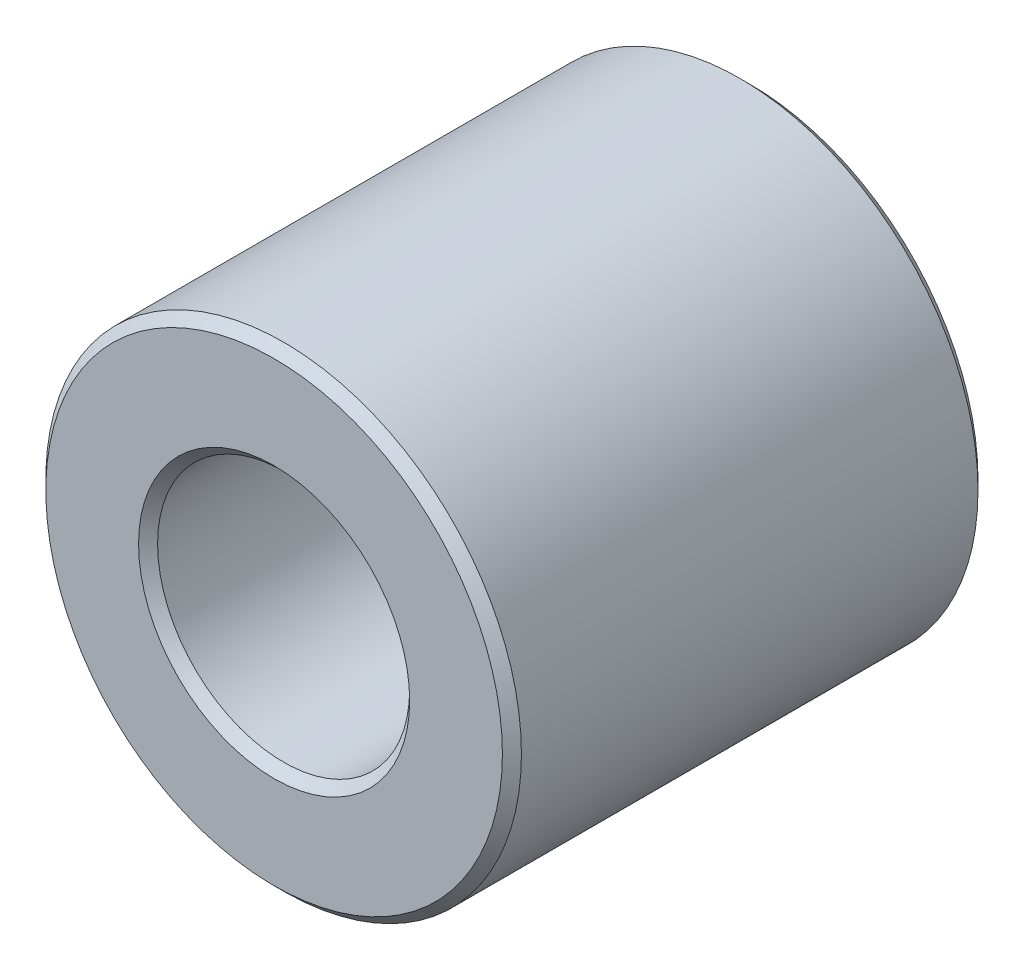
ISO-10303-21;
HEADER;
FILE_DESCRIPTION(('STEP AP214'),'2;1');
FILE_NAME('part.step','',(''),(''),'','','');
FILE_SCHEMA(('AUTOMOTIVE_DESIGN { 1 0 10303 214 1 1 1 1 }'));
ENDSEC;
DATA;
#1=APPLICATION_CONTEXT('core data for automotive mechanical design processes');
#2=APPLICATION_PROTOCOL_DEFINITION('international standard','automotive_design',2000,#1);
#3=PRODUCT_CONTEXT('',#1,'mechanical');
#4=PRODUCT('Part','Part','',(#3));
#5=PRODUCT_RELATED_PRODUCT_CATEGORY('part','',(#4));
#6=PRODUCT_DEFINITION_FORMATION('','',#4);
#7=PRODUCT_DEFINITION_CONTEXT('part definition',#1,'design');
#8=PRODUCT_DEFINITION('design','',#6,#7);
#9=PRODUCT_DEFINITION_SHAPE('','',#8);
#10=(LENGTH_UNIT() NAMED_UNIT(*) SI_UNIT(.MILLI.,.METRE.));
#11=(NAMED_UNIT(*) PLANE_ANGLE_UNIT() SI_UNIT($,.RADIAN.));
#12=(NAMED_UNIT(*) SI_UNIT($,.STERADIAN.) SOLID_ANGLE_UNIT());
#13=UNCERTAINTY_MEASURE_WITH_UNIT(LENGTH_MEASURE(1.E-05),#10,'distance_accuracy_value','');
#14=(GEOMETRIC_REPRESENTATION_CONTEXT(3) GLOBAL_UNCERTAINTY_ASSIGNED_CONTEXT((#13)) GLOBAL_UNIT_ASSIGNED_CONTEXT((#10,
#11,#12)) REPRESENTATION_CONTEXT('',''));
#15=CARTESIAN_POINT('',(0.,0.,0.));
#16=DIRECTION('',(0.,0.,1.));
#17=DIRECTION('',(1.,0.,0.));
#18=AXIS2_PLACEMENT_3D('',#15,#16,#17);
#19=CARTESIAN_POINT('',(0.,0.,5.));
#20=DIRECTION('',(0.,0.,1.));
#21=DIRECTION('',(1.,0.,0.));
#22=AXIS2_PLACEMENT_3D('',#19,#20,#21);
#23=PLANE('',#22);
#24=CARTESIAN_POINT('',(0.,0.,5.));
#25=DIRECTION('',(0.,0.,1.));
#26=DIRECTION('',(1.,0.,0.));
#27=AXIS2_PLACEMENT_3D('',#24,#25,#26);
#28=CIRCLE('',#27,2.85000000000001);
#29=CARTESIAN_POINT('',(2.85000000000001,0.,5.));
#30=VERTEX_POINT('',#29);
#31=EDGE_CURVE('E10',#30,#30,#28,.F.);
#32=ORIENTED_EDGE('',*,*,#31,.T.);
#33=EDGE_LOOP('',(#32));
#34=FACE_BOUND('',#33,.T.);
#35=CARTESIAN_POINT('',(0.,0.,5.));
#36=DIRECTION('',(0.,0.,1.));
#37=DIRECTION('',(1.,0.,0.));
#38=AXIS2_PLACEMENT_3D('',#35,#36,#37);
#39=CIRCLE('',#38,4.8);
#40=CARTESIAN_POINT('',(4.8,0.,5.));
#41=VERTEX_POINT('',#40);
#42=EDGE_CURVE('E45',#41,#41,#39,.T.);
#43=ORIENTED_EDGE('',*,*,#42,.T.);
#44=EDGE_LOOP('',(#43));
#45=FACE_BOUND('',#44,.T.);
#46=ADVANCED_FACE('F37',(#34,#45),#23,.T.);
#47=CARTESIAN_POINT('',(0.,0.,-5.));
#48=DIRECTION('',(0.,0.,1.));
#49=DIRECTION('',(1.,0.,0.));
#50=AXIS2_PLACEMENT_3D('',#47,#48,#49);
#51=PLANE('',#50);
#52=CARTESIAN_POINT('',(0.,0.,-5.));
#53=DIRECTION('',(0.,0.,1.));
#54=DIRECTION('',(1.,0.,0.));
#55=AXIS2_PLACEMENT_3D('',#52,#53,#54);
#56=CIRCLE('',#55,4.8);
#57=CARTESIAN_POINT('',(4.8,0.,-5.));
#58=VERTEX_POINT('',#57);
#59=EDGE_CURVE('E65',#58,#58,#56,.F.);
#60=ORIENTED_EDGE('',*,*,#59,.T.);
#61=EDGE_LOOP('',(#60));
#62=FACE_BOUND('',#61,.T.);
#63=CARTESIAN_POINT('',(0.,0.,-5.));
#64=DIRECTION('',(0.,0.,1.));
#65=DIRECTION('',(1.,0.,0.));
#66=AXIS2_PLACEMENT_3D('',#63,#64,#65);
#67=CIRCLE('',#66,2.85);
#68=CARTESIAN_POINT('',(2.85,0.,-5.));
#69=VERTEX_POINT('',#68);
#70=EDGE_CURVE('E68',#69,#69,#67,.T.);
#71=ORIENTED_EDGE('',*,*,#70,.T.);
#72=EDGE_LOOP('',(#71));
#73=FACE_BOUND('',#72,.T.);
#74=ADVANCED_FACE('F89',(#62,#73),#51,.F.);
#75=CARTESIAN_POINT('',(0.,0.,5.));
#76=DIRECTION('',(0.,0.,-1.));
#77=DIRECTION('',(-1.,0.,0.));
#78=AXIS2_PLACEMENT_3D('',#75,#76,#77);
#79=CYLINDRICAL_SURFACE('',#78,5.);
#80=CARTESIAN_POINT('',(0.,0.,-4.8));
#81=DIRECTION('',(0.,0.,1.));
#82=DIRECTION('',(1.,0.,0.));
#83=AXIS2_PLACEMENT_3D('',#80,#81,#82);
#84=CIRCLE('',#83,5.);
#85=CARTESIAN_POINT('',(5.,0.,-4.8));
#86=VERTEX_POINT('',#85);
#87=EDGE_CURVE('E71',#86,#86,#84,.T.);
#88=ORIENTED_EDGE('',*,*,#87,.T.);
#89=EDGE_LOOP('',(#88));
#90=FACE_BOUND('',#89,.T.);
#91=CARTESIAN_POINT('',(0.,0.,4.8));
#92=DIRECTION('',(0.,0.,1.));
#93=DIRECTION('',(1.,0.,0.));
#94=AXIS2_PLACEMENT_3D('',#91,#92,#93);
#95=CIRCLE('',#94,5.);
#96=CARTESIAN_POINT('',(5.,0.,4.8));
#97=VERTEX_POINT('',#96);
#98=EDGE_CURVE('E74',#97,#97,#95,.F.);
#99=ORIENTED_EDGE('',*,*,#98,.T.);
#100=EDGE_LOOP('',(#99));
#101=FACE_BOUND('',#100,.T.);
#102=ADVANCED_FACE('F78',(#90,#101),#79,.T.);
#103=CARTESIAN_POINT('',(0.,0.,5.));
#104=DIRECTION('',(0.,0.,-1.));
#105=DIRECTION('',(-1.,0.,0.));
#106=AXIS2_PLACEMENT_3D('',#103,#104,#105);
#107=CYLINDRICAL_SURFACE('',#106,2.65);
#108=CARTESIAN_POINT('',(0.,0.,-4.8));
#109=DIRECTION('',(0.,0.,1.));
#110=DIRECTION('',(1.,0.,0.));
#111=AXIS2_PLACEMENT_3D('',#108,#109,#110);
#112=CIRCLE('',#111,2.65);
#113=CARTESIAN_POINT('',(2.65,0.,-4.8));
#114=VERTEX_POINT('',#113);
#115=EDGE_CURVE('E52',#114,#114,#112,.F.);
#116=ORIENTED_EDGE('',*,*,#115,.T.);
#117=EDGE_LOOP('',(#116));
#118=FACE_BOUND('',#117,.T.);
#119=CARTESIAN_POINT('',(0.,0.,4.8));
#120=DIRECTION('',(0.,0.,1.));
#121=DIRECTION('',(1.,0.,0.));
#122=AXIS2_PLACEMENT_3D('',#119,#120,#121);
#123=CIRCLE('',#122,2.65);
#124=CARTESIAN_POINT('',(2.65,0.,4.8));
#125=VERTEX_POINT('',#124);
#126=EDGE_CURVE('E59',#125,#125,#123,.T.);
#127=ORIENTED_EDGE('',*,*,#126,.T.);
#128=EDGE_LOOP('',(#127));
#129=FACE_BOUND('',#128,.T.);
#130=ADVANCED_FACE('F97',(#118,#129),#107,.F.);
#131=CARTESIAN_POINT('',(0.,0.,-4.8));
#132=DIRECTION('',(0.,0.,1.));
#133=DIRECTION('',(1.,0.,0.));
#134=AXIS2_PLACEMENT_3D('',#131,#132,#133);
#135=CONICAL_SURFACE('',#134,5.,0.785398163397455);
#136=ORIENTED_EDGE('',*,*,#59,.F.);
#137=EDGE_LOOP('',(#136));
#138=FACE_BOUND('',#137,.T.);
#139=ORIENTED_EDGE('',*,*,#87,.F.);
#140=EDGE_LOOP('',(#139));
#141=FACE_BOUND('',#140,.T.);
#142=ADVANCED_FACE('F102',(#138,#141),#135,.T.);
#143=CARTESIAN_POINT('',(0.,0.,-5.));
#144=DIRECTION('',(0.,0.,-1.));
#145=DIRECTION('',(-1.,0.,0.));
#146=AXIS2_PLACEMENT_3D('',#143,#144,#145);
#147=CONICAL_SURFACE('',#146,2.85,0.785398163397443);
#148=ORIENTED_EDGE('',*,*,#115,.F.);
#149=EDGE_LOOP('',(#148));
#150=FACE_BOUND('',#149,.T.);
#151=ORIENTED_EDGE('',*,*,#70,.F.);
#152=EDGE_LOOP('',(#151));
#153=FACE_BOUND('',#152,.T.);
#154=ADVANCED_FACE('F86',(#150,#153),#147,.F.);
#155=CARTESIAN_POINT('',(0.,0.,4.8));
#156=DIRECTION('',(0.,0.,1.));
#157=DIRECTION('',(1.,0.,0.));
#158=AXIS2_PLACEMENT_3D('',#155,#156,#157);
#159=CONICAL_SURFACE('',#158,2.65,0.785398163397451);
#160=ORIENTED_EDGE('',*,*,#31,.F.);
#161=EDGE_LOOP('',(#160));
#162=FACE_BOUND('',#161,.T.);
#163=ORIENTED_EDGE('',*,*,#126,.F.);
#164=EDGE_LOOP('',(#163));
#165=FACE_BOUND('',#164,.T.);
#166=ADVANCED_FACE('F82',(#162,#165),#159,.F.);
#167=CARTESIAN_POINT('',(0.,0.,5.));
#168=DIRECTION('',(0.,0.,-1.));
#169=DIRECTION('',(-1.,0.,0.));
#170=AXIS2_PLACEMENT_3D('',#167,#168,#169);
#171=CONICAL_SURFACE('',#170,4.8,0.785398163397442);
#172=ORIENTED_EDGE('',*,*,#98,.F.);
#173=EDGE_LOOP('',(#172));
#174=FACE_BOUND('',#173,.T.);
#175=ORIENTED_EDGE('',*,*,#42,.F.);
#176=EDGE_LOOP('',(#175));
#177=FACE_BOUND('',#176,.T.);
#178=ADVANCED_FACE('F39',(#174,#177),#171,.T.);
#179=CLOSED_SHELL('',(#46,#74,#102,#130,#142,#154,#166,#178));
#180=MANIFOLD_SOLID_BREP('B2',#179);
#181=ADVANCED_BREP_SHAPE_REPRESENTATION('',(#18,#180),#14);
#182=SHAPE_DEFINITION_REPRESENTATION(#9,#181);
ENDSEC;
END-ISO-10303-21;
